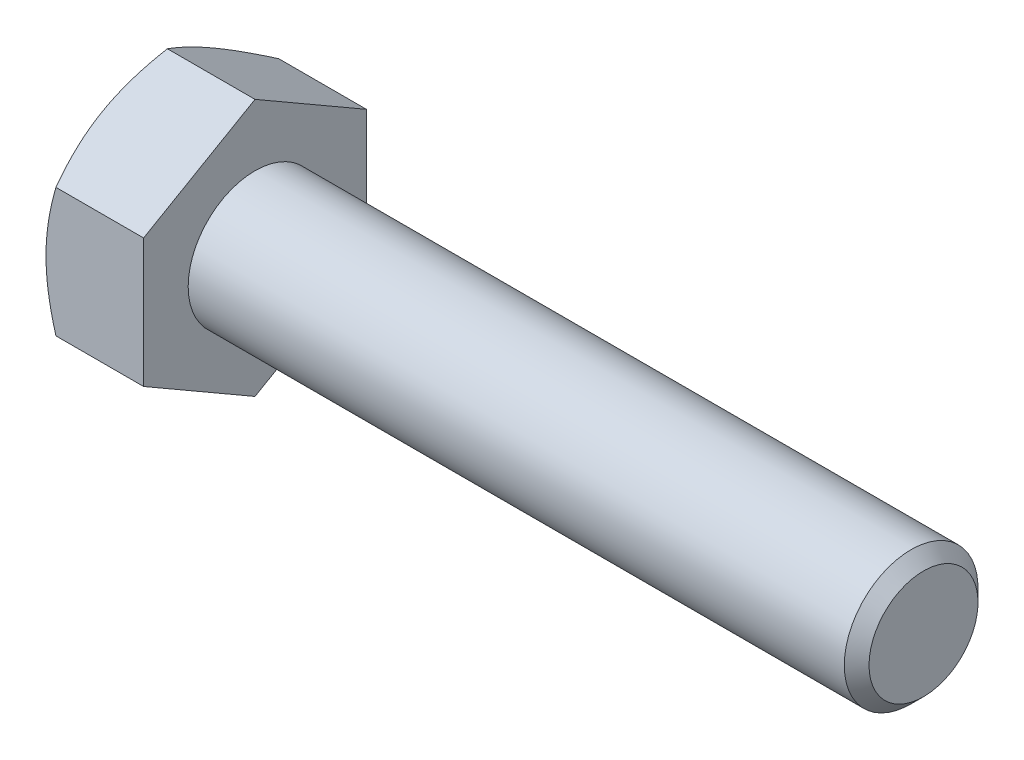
ISO-10303-21;
HEADER;
FILE_DESCRIPTION(('STEP AP214'),'2;1');
FILE_NAME('part.step','',(''),(''),'','','');
FILE_SCHEMA(('AUTOMOTIVE_DESIGN { 1 0 10303 214 1 1 1 1 }'));
ENDSEC;
DATA;
#1=APPLICATION_CONTEXT('core data for automotive mechanical design processes');
#2=APPLICATION_PROTOCOL_DEFINITION('international standard','automotive_design',2000,#1);
#3=PRODUCT_CONTEXT('',#1,'mechanical');
#4=PRODUCT('Part','Part','',(#3));
#5=PRODUCT_RELATED_PRODUCT_CATEGORY('part','',(#4));
#6=PRODUCT_DEFINITION_FORMATION('','',#4);
#7=PRODUCT_DEFINITION_CONTEXT('part definition',#1,'design');
#8=PRODUCT_DEFINITION('design','',#6,#7);
#9=PRODUCT_DEFINITION_SHAPE('','',#8);
#10=(LENGTH_UNIT() NAMED_UNIT(*) SI_UNIT(.MILLI.,.METRE.));
#11=(NAMED_UNIT(*) PLANE_ANGLE_UNIT() SI_UNIT($,.RADIAN.));
#12=(NAMED_UNIT(*) SI_UNIT($,.STERADIAN.) SOLID_ANGLE_UNIT());
#13=UNCERTAINTY_MEASURE_WITH_UNIT(LENGTH_MEASURE(1.E-05),#10,'distance_accuracy_value','');
#14=(GEOMETRIC_REPRESENTATION_CONTEXT(3) GLOBAL_UNCERTAINTY_ASSIGNED_CONTEXT((#13)) GLOBAL_UNIT_ASSIGNED_CONTEXT((#10,
#11,#12)) REPRESENTATION_CONTEXT('',''));
#15=CARTESIAN_POINT('',(0.,0.,0.));
#16=DIRECTION('',(0.,0.,1.));
#17=DIRECTION('',(1.,0.,0.));
#18=AXIS2_PLACEMENT_3D('',#15,#16,#17);
#19=CARTESIAN_POINT('',(4.38,2.88675134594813,-5.));
#20=DIRECTION('',(0.,-0.866025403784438,0.500000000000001));
#21=DIRECTION('',(0.,-0.500000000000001,-0.866025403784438));
#22=AXIS2_PLACEMENT_3D('',#19,#20,#21);
#23=PLANE('',#22);
#24=CARTESIAN_POINT('',(0.446648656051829,5.7736181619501,0.000200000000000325));
#25=CARTESIAN_POINT('',(0.373386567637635,5.64675433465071,-0.219534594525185));
#26=CARTESIAN_POINT('',(0.306751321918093,5.5188054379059,-0.44114858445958));
#27=CARTESIAN_POINT('',(0.190438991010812,5.26069210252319,-0.888213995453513));
#28=CARTESIAN_POINT('',(0.14080304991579,5.13052307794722,-1.11367335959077));
#29=CARTESIAN_POINT('',(0.0635510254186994,4.87177839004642,-1.56183230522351));
#30=CARTESIAN_POINT('',(0.035420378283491,4.74324302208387,-1.78446209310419));
#31=CARTESIAN_POINT('',(0.010194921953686,4.54998783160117,-2.11918990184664));
#32=CARTESIAN_POINT('',(0.00461345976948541,4.48552534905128,-2.23084219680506));
#33=CARTESIAN_POINT('',(-0.000797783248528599,4.35654081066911,-2.4542499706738));
#34=CARTESIAN_POINT('',(-0.000627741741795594,4.2920187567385,-2.56600544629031));
#35=CARTESIAN_POINT('',(0.00775363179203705,4.11524635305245,-2.87218423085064));
#36=CARTESIAN_POINT('',(0.0218297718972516,4.00305457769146,-3.06650608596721));
#37=CARTESIAN_POINT('',(0.06646525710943,3.77941563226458,-3.4538601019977));
#38=CARTESIAN_POINT('',(0.0970398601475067,3.66796924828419,-3.64689090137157));
#39=CARTESIAN_POINT('',(0.173468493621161,3.44387972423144,-4.03502534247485));
#40=CARTESIAN_POINT('',(0.219646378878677,3.3312648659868,-4.23007999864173));
#41=CARTESIAN_POINT('',(0.32445179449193,3.1077146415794,-4.61728034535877));
#42=CARTESIAN_POINT('',(0.38305470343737,2.99677641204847,-4.80943099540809));
#43=CARTESIAN_POINT('',(0.446648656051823,2.88663587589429,-5.0002));
#44=B_SPLINE_CURVE_WITH_KNOTS('',3,(#24,#25,#26,#27,#28,#29,#30,#31,#32,#33,#34,#35,#36,#37,#38,
#39,#40,#41,#42,#43),.UNSPECIFIED.,.F.,.F.,(4,2,2,2,2,2,2,2,2,4),(0.,0.792555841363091,
1.58701660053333,2.36181537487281,2.74884076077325,3.13585419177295,3.80962362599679,
4.48401723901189,5.17336882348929,5.86136694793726),.UNSPECIFIED.);
#45=CARTESIAN_POINT('',(0.446581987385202,5.77350269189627,0.));
#46=VERTEX_POINT('',#45);
#47=CARTESIAN_POINT('',(0.,4.33012701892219,-2.50000000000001));
#48=VERTEX_POINT('',#47);
#49=EDGE_CURVE('E47',#46,#48,#44,.T.);
#50=ORIENTED_EDGE('',*,*,#49,.F.);
#51=DIRECTION('',(-1.,0.,0.));
#52=VECTOR('',#51,1.);
#53=CARTESIAN_POINT('',(4.38,5.77350269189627,0.));
#54=LINE('',#53,#52);
#55=CARTESIAN_POINT('',(4.38,5.77350269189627,0.));
#56=VERTEX_POINT('',#55);
#57=EDGE_CURVE('E143',#56,#46,#54,.T.);
#58=ORIENTED_EDGE('',*,*,#57,.F.);
#59=DIRECTION('',(0.,0.500000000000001,0.866025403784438));
#60=VECTOR('',#59,1.);
#61=CARTESIAN_POINT('',(4.38,2.88675134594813,-5.));
#62=LINE('',#61,#60);
#63=CARTESIAN_POINT('',(4.38,2.88675134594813,-5.));
#64=VERTEX_POINT('',#63);
#65=EDGE_CURVE('E228',#64,#56,#62,.T.);
#66=ORIENTED_EDGE('',*,*,#65,.F.);
#67=DIRECTION('',(-1.,0.,0.));
#68=VECTOR('',#67,1.);
#69=CARTESIAN_POINT('',(4.38,2.88675134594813,-5.));
#70=LINE('',#69,#68);
#71=CARTESIAN_POINT('',(0.446581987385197,2.88675134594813,-5.));
#72=VERTEX_POINT('',#71);
#73=EDGE_CURVE('E131',#64,#72,#70,.T.);
#74=ORIENTED_EDGE('',*,*,#73,.T.);
#75=EDGE_CURVE('E125',#48,#72,#44,.T.);
#76=ORIENTED_EDGE('',*,*,#75,.F.);
#77=EDGE_LOOP('',(#50,#58,#66,#74,#76));
#78=FACE_BOUND('',#77,.T.);
#79=ADVANCED_FACE('F31',(#78),#23,.F.);
#80=CARTESIAN_POINT('',(4.38,5.77350269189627,0.));
#81=DIRECTION('',(0.,-0.866025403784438,-0.500000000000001));
#82=DIRECTION('',(0.,0.500000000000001,-0.866025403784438));
#83=AXIS2_PLACEMENT_3D('',#80,#81,#82);
#84=PLANE('',#83);
#85=CARTESIAN_POINT('',(0.446648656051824,2.88663587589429,5.0002));
#86=CARTESIAN_POINT('',(0.373386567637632,3.01349970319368,4.78046540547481));
#87=CARTESIAN_POINT('',(0.30675132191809,3.14144859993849,4.55885141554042));
#88=CARTESIAN_POINT('',(0.19043899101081,3.39956193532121,4.11178600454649));
#89=CARTESIAN_POINT('',(0.140803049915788,3.52973095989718,3.88632664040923));
#90=CARTESIAN_POINT('',(0.0635510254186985,3.78847564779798,3.43816769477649));
#91=CARTESIAN_POINT('',(0.035420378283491,3.91701101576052,3.21553790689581));
#92=CARTESIAN_POINT('',(0.0101949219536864,4.11026620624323,2.88081009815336));
#93=CARTESIAN_POINT('',(0.00461345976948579,4.17472868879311,2.76915780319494));
#94=CARTESIAN_POINT('',(-0.000797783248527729,4.30371322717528,2.5457500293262));
#95=CARTESIAN_POINT('',(-0.000627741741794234,4.36823528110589,2.43399455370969));
#96=CARTESIAN_POINT('',(0.0077536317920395,4.54500768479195,2.12781576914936));
#97=CARTESIAN_POINT('',(0.0218297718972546,4.65719946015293,1.93349391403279));
#98=CARTESIAN_POINT('',(0.0664652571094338,4.88083840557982,1.5461398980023));
#99=CARTESIAN_POINT('',(0.097039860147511,4.99228478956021,1.35310909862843));
#100=CARTESIAN_POINT('',(0.173468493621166,5.21637431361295,0.964974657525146));
#101=CARTESIAN_POINT('',(0.219646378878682,5.32898917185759,0.769920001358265));
#102=CARTESIAN_POINT('',(0.324451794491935,5.55253939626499,0.382719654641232));
#103=CARTESIAN_POINT('',(0.383054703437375,5.66347762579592,0.190569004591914));
#104=CARTESIAN_POINT('',(0.446648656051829,5.7736181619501,-0.000199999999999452));
#105=B_SPLINE_CURVE_WITH_KNOTS('',3,(#85,#86,#87,#88,#89,#90,#91,#92,#93,#94,#95,#96,#97,#98,
#99,#100,#101,#102,#103,#104),.UNSPECIFIED.,.F.,.F.,(4,2,2,2,2,2,2,2,2,4),(0.,0.79255584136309,
1.58701660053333,2.3618153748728,2.74884076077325,3.13585419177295,3.80962362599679,
4.48401723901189,5.17336882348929,5.86136694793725),.UNSPECIFIED.);
#106=CARTESIAN_POINT('',(0.446581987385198,2.88675134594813,5.));
#107=VERTEX_POINT('',#106);
#108=CARTESIAN_POINT('',(0.,4.33012701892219,2.5));
#109=VERTEX_POINT('',#108);
#110=EDGE_CURVE('E54',#107,#109,#105,.T.);
#111=ORIENTED_EDGE('',*,*,#110,.F.);
#112=DIRECTION('',(-1.,0.,0.));
#113=VECTOR('',#112,1.);
#114=CARTESIAN_POINT('',(4.38,2.88675134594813,5.));
#115=LINE('',#114,#113);
#116=CARTESIAN_POINT('',(4.38,2.88675134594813,5.));
#117=VERTEX_POINT('',#116);
#118=EDGE_CURVE('E141',#117,#107,#115,.T.);
#119=ORIENTED_EDGE('',*,*,#118,.F.);
#120=DIRECTION('',(0.,-0.500000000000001,0.866025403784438));
#121=VECTOR('',#120,1.);
#122=CARTESIAN_POINT('',(4.38,5.77350269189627,0.));
#123=LINE('',#122,#121);
#124=EDGE_CURVE('E226',#56,#117,#123,.T.);
#125=ORIENTED_EDGE('',*,*,#124,.F.);
#126=ORIENTED_EDGE('',*,*,#57,.T.);
#127=EDGE_CURVE('E158',#109,#46,#105,.T.);
#128=ORIENTED_EDGE('',*,*,#127,.F.);
#129=EDGE_LOOP('',(#111,#119,#125,#126,#128));
#130=FACE_BOUND('',#129,.T.);
#131=ADVANCED_FACE('F164',(#130),#84,.F.);
#132=CARTESIAN_POINT('',(4.38,2.88675134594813,5.));
#133=DIRECTION('',(0.,0.,-1.));
#134=DIRECTION('',(0.,1.,0.));
#135=AXIS2_PLACEMENT_3D('',#132,#133,#134);
#136=PLANE('',#135);
#137=CARTESIAN_POINT('',(2.47533544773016,-7.82661640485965,5.));
#138=CARTESIAN_POINT('',(2.36879683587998,-7.60758613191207,5.));
#139=CARTESIAN_POINT('',(2.26325911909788,-7.38806071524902,5.));
#140=CARTESIAN_POINT('',(2.05474707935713,-6.94775649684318,5.));
#141=CARTESIAN_POINT('',(1.95177314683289,-6.72697751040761,5.));
#142=CARTESIAN_POINT('',(1.74844778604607,-6.28280027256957,5.));
#143=CARTESIAN_POINT('',(1.64811306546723,-6.05939434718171,5.));
#144=CARTESIAN_POINT('',(1.45145486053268,-5.61083043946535,5.));
#145=CARTESIAN_POINT('',(1.35513119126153,-5.38567253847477,5.));
#146=CARTESIAN_POINT('',(1.1644503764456,-4.92576614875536,5.));
#147=CARTESIAN_POINT('',(1.07026351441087,-4.69094667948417,5.));
#148=CARTESIAN_POINT('',(0.888844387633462,-4.21858752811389,5.));
#149=CARTESIAN_POINT('',(0.801612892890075,-3.9810475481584,5.));
#150=CARTESIAN_POINT('',(0.636341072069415,-3.50329086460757,5.));
#151=CARTESIAN_POINT('',(0.558282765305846,-3.26308044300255,5.));
#152=CARTESIAN_POINT('',(0.413813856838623,-2.77921467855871,5.));
#153=CARTESIAN_POINT('',(0.347399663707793,-2.53556042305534,5.));
#154=CARTESIAN_POINT('',(0.229707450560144,-2.04600448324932,5.));
#155=CARTESIAN_POINT('',(0.178346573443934,-1.80012308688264,5.));
#156=CARTESIAN_POINT('',(0.093623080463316,-1.30522837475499,5.));
#157=CARTESIAN_POINT('',(0.0602585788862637,-1.05621538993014,5.));
#158=CARTESIAN_POINT('',(0.0146229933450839,-0.559584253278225,5.));
#159=CARTESIAN_POINT('',(0.00207498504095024,-0.31199219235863,5.));
#160=CARTESIAN_POINT('',(-0.00159747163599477,0.183375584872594,5.));
#161=CARTESIAN_POINT('',(0.0072784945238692,0.431151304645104,5.));
#162=CARTESIAN_POINT('',(0.039726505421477,0.849622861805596,5.));
#163=CARTESIAN_POINT('',(0.0579847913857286,1.02075746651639,5.));
#164=CARTESIAN_POINT('',(0.103624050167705,1.36181398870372,5.));
#165=CARTESIAN_POINT('',(0.131006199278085,1.53173574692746,5.));
#166=CARTESIAN_POINT('',(0.225403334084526,2.03942834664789,5.));
#167=CARTESIAN_POINT('',(0.304653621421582,2.37495177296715,5.));
#168=CARTESIAN_POINT('',(0.442611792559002,2.87686006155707,5.));
#169=CARTESIAN_POINT('',(0.49245303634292,3.04583048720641,5.));
#170=CARTESIAN_POINT('',(0.597441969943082,3.38213061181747,5.));
#171=CARTESIAN_POINT('',(0.652589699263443,3.5494602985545,5.));
#172=CARTESIAN_POINT('',(0.767295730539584,3.88253122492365,5.));
#173=CARTESIAN_POINT('',(0.826852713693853,4.04827292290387,5.));
#174=CARTESIAN_POINT('',(0.949663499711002,4.37837269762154,5.));
#175=CARTESIAN_POINT('',(1.01291722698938,4.54273080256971,5.));
#176=CARTESIAN_POINT('',(1.18384085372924,4.9746759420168,5.));
#177=CARTESIAN_POINT('',(1.29410564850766,5.24123504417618,5.));
#178=CARTESIAN_POINT('',(1.52085041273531,5.77170603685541,5.));
#179=CARTESIAN_POINT('',(1.63733099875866,6.03561766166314,5.));
#180=CARTESIAN_POINT('',(1.87507624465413,6.56138078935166,5.));
#181=CARTESIAN_POINT('',(1.99634255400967,6.82323154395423,5.));
#182=CARTESIAN_POINT('',(2.24254703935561,7.34518395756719,5.));
#183=CARTESIAN_POINT('',(2.36748508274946,7.60528567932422,5.));
#184=CARTESIAN_POINT('',(2.62044102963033,8.1244647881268,5.));
#185=CARTESIAN_POINT('',(2.74846325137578,8.38354006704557,5.));
#186=CARTESIAN_POINT('',(3.00682669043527,8.90053291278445,5.));
#187=CARTESIAN_POINT('',(3.1371679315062,9.15845046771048,5.));
#188=CARTESIAN_POINT('',(3.53092424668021,9.93067662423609,5.));
#189=CARTESIAN_POINT('',(3.79712405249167,10.443564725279,5.));
#190=CARTESIAN_POINT('',(4.30724046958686,11.4147548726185,5.));
#191=CARTESIAN_POINT('',(4.55067498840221,11.8733113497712,5.));
#192=CARTESIAN_POINT('',(5.04052915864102,12.7888590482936,5.));
#193=CARTESIAN_POINT('',(5.28694897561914,13.2458501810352,5.));
#194=CARTESIAN_POINT('',(5.78122505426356,14.1571829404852,5.));
#195=CARTESIAN_POINT('',(6.02907430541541,14.6115283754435,5.));
#196=CARTESIAN_POINT('',(6.52648185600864,15.519239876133,5.));
#197=CARTESIAN_POINT('',(6.77604002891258,15.9726060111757,5.));
#198=CARTESIAN_POINT('',(7.02622264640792,16.4256251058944,4.99999999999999));
#199=B_SPLINE_CURVE_WITH_KNOTS('',3,(#137,#138,#139,#140,#141,#142,#143,#144,#145,#146,#147,
#148,#149,#150,#151,#152,#153,#154,#155,#156,#157,#158,#159,#160,#161,#162,#163,#164,#165,#166,
#167,#168,#169,#170,#171,#172,#173,#174,#175,#176,#177,#178,#179,#180,#181,#182,#183,#184,#185,
#186,#187,#188,#189,#190,#191,#192,#193,#194,#195,#196,#197,#198),.UNSPECIFIED.,.F.,.F.,(4,2,2,
2,2,2,2,2,2,2,2,2,2,2,2,2,2,2,2,2,2,2,2,2,2,2,2,2,2,2,4),(0.,0.730708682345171,1.46152797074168,
2.19620403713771,2.93084619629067,3.6897749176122,4.4487875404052,5.20628666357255,
5.96355173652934,6.71656679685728,7.46950293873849,8.21233991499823,8.95519126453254,
9.4712599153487,9.98739512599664,11.0201893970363,11.5486465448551,12.0771076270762,
12.6054112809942,13.1337041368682,13.9989833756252,14.8643486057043,15.7300147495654,
16.5956496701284,17.4625765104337,18.329512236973,20.0630293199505,21.6205191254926,
23.178095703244,24.7307447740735,26.2832800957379),.UNSPECIFIED.);
#200=CARTESIAN_POINT('',(0.446581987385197,-2.88675134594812,5.));
#201=VERTEX_POINT('',#200);
#202=CARTESIAN_POINT('',(0.,0.,5.));
#203=VERTEX_POINT('',#202);
#204=EDGE_CURVE('E238',#201,#203,#199,.T.);
#205=ORIENTED_EDGE('',*,*,#204,.F.);
#206=DIRECTION('',(-1.,0.,0.));
#207=VECTOR('',#206,1.);
#208=CARTESIAN_POINT('',(4.38,-2.88675134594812,5.));
#209=LINE('',#208,#207);
#210=CARTESIAN_POINT('',(4.38,-2.88675134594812,5.));
#211=VERTEX_POINT('',#210);
#212=EDGE_CURVE('E133',#211,#201,#209,.T.);
#213=ORIENTED_EDGE('',*,*,#212,.F.);
#214=DIRECTION('',(0.,-1.,0.));
#215=VECTOR('',#214,1.);
#216=CARTESIAN_POINT('',(4.38,2.88675134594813,5.));
#217=LINE('',#216,#215);
#218=EDGE_CURVE('E222',#117,#211,#217,.T.);
#219=ORIENTED_EDGE('',*,*,#218,.F.);
#220=ORIENTED_EDGE('',*,*,#118,.T.);
#221=EDGE_CURVE('E180',#203,#107,#199,.T.);
#222=ORIENTED_EDGE('',*,*,#221,.F.);
#223=EDGE_LOOP('',(#205,#213,#219,#220,#222));
#224=FACE_BOUND('',#223,.T.);
#225=ADVANCED_FACE('F244',(#224),#136,.F.);
#226=CARTESIAN_POINT('',(4.38,-5.77350269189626,0.));
#227=DIRECTION('',(0.,0.866025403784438,-0.500000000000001));
#228=DIRECTION('',(0.,0.500000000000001,0.866025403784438));
#229=AXIS2_PLACEMENT_3D('',#226,#227,#228);
#230=PLANE('',#229);
#231=CARTESIAN_POINT('',(0.446648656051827,-5.7736181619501,-0.000199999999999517));
#232=CARTESIAN_POINT('',(0.373386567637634,-5.64675433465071,0.219534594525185));
#233=CARTESIAN_POINT('',(0.306751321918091,-5.5188054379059,0.44114858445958));
#234=CARTESIAN_POINT('',(0.19043899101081,-5.26069210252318,0.888213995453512));
#235=CARTESIAN_POINT('',(0.140803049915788,-5.13052307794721,1.11367335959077));
#236=CARTESIAN_POINT('',(0.0635510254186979,-4.87177839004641,1.56183230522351));
#237=CARTESIAN_POINT('',(0.0354203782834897,-4.74324302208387,1.78446209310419));
#238=CARTESIAN_POINT('',(0.0101949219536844,-4.54998783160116,2.11918990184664));
#239=CARTESIAN_POINT('',(0.00461345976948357,-4.48552534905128,2.23084219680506));
#240=CARTESIAN_POINT('',(-0.000797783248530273,-4.35654081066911,2.4542499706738));
#241=CARTESIAN_POINT('',(-0.000627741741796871,-4.2920187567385,2.56600544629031));
#242=CARTESIAN_POINT('',(0.00775363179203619,-4.11524635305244,2.87218423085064));
#243=CARTESIAN_POINT('',(0.0218297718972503,-4.00305457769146,3.06650608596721));
#244=CARTESIAN_POINT('',(0.0664652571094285,-3.77941563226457,3.4538601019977));
#245=CARTESIAN_POINT('',(0.0970398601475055,-3.66796924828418,3.64689090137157));
#246=CARTESIAN_POINT('',(0.173468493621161,-3.44387972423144,4.03502534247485));
#247=CARTESIAN_POINT('',(0.219646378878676,-3.3312648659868,4.23007999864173));
#248=CARTESIAN_POINT('',(0.32445179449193,-3.1077146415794,4.61728034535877));
#249=CARTESIAN_POINT('',(0.383054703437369,-2.99677641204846,4.80943099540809));
#250=CARTESIAN_POINT('',(0.446648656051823,-2.88663587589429,5.0002));
#251=B_SPLINE_CURVE_WITH_KNOTS('',3,(#231,#232,#233,#234,#235,#236,#237,#238,#239,#240,#241,
#242,#243,#244,#245,#246,#247,#248,#249,#250),.UNSPECIFIED.,.F.,.F.,(4,2,2,2,2,2,2,2,2,4),(0.,
0.79255584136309,1.58701660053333,2.3618153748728,2.74884076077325,3.13585419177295,
3.80962362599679,4.48401723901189,5.17336882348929,5.86136694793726),.UNSPECIFIED.);
#252=CARTESIAN_POINT('',(0.4465819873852,-5.77350269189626,0.));
#253=VERTEX_POINT('',#252);
#254=CARTESIAN_POINT('',(0.,-4.33012701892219,2.50000000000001));
#255=VERTEX_POINT('',#254);
#256=EDGE_CURVE('E166',#253,#255,#251,.T.);
#257=ORIENTED_EDGE('',*,*,#256,.F.);
#258=DIRECTION('',(-1.,0.,0.));
#259=VECTOR('',#258,1.);
#260=CARTESIAN_POINT('',(4.38,-5.77350269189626,0.));
#261=LINE('',#260,#259);
#262=CARTESIAN_POINT('',(4.38,-5.77350269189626,0.));
#263=VERTEX_POINT('',#262);
#264=EDGE_CURVE('E130',#263,#253,#261,.T.);
#265=ORIENTED_EDGE('',*,*,#264,.F.);
#266=DIRECTION('',(0.,-0.500000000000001,-0.866025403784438));
#267=VECTOR('',#266,1.);
#268=CARTESIAN_POINT('',(4.38,-5.77350269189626,0.));
#269=LINE('',#268,#267);
#270=EDGE_CURVE('E220',#211,#263,#269,.T.);
#271=ORIENTED_EDGE('',*,*,#270,.F.);
#272=ORIENTED_EDGE('',*,*,#212,.T.);
#273=EDGE_CURVE('E168',#255,#201,#251,.T.);
#274=ORIENTED_EDGE('',*,*,#273,.F.);
#275=EDGE_LOOP('',(#257,#265,#271,#272,#274));
#276=FACE_BOUND('',#275,.T.);
#277=ADVANCED_FACE('F216',(#276),#230,.F.);
#278=CARTESIAN_POINT('',(4.38,-2.88675134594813,-5.));
#279=DIRECTION('',(0.,0.866025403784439,0.5));
#280=DIRECTION('',(0.,-0.5,0.866025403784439));
#281=AXIS2_PLACEMENT_3D('',#278,#279,#280);
#282=PLANE('',#281);
#283=CARTESIAN_POINT('',(0.446648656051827,-2.8866358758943,-5.0002));
#284=CARTESIAN_POINT('',(0.373386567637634,-3.01349970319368,-4.78046540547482));
#285=CARTESIAN_POINT('',(0.306751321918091,-3.1414485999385,-4.55885141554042));
#286=CARTESIAN_POINT('',(0.190438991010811,-3.39956193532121,-4.11178600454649));
#287=CARTESIAN_POINT('',(0.14080304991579,-3.52973095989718,-3.88632664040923));
#288=CARTESIAN_POINT('',(0.0635510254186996,-3.78847564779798,-3.43816769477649));
#289=CARTESIAN_POINT('',(0.0354203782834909,-3.91701101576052,-3.21553790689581));
#290=CARTESIAN_POINT('',(0.0101949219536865,-4.11026620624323,-2.88081009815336));
#291=CARTESIAN_POINT('',(0.00461345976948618,-4.17472868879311,-2.76915780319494));
#292=CARTESIAN_POINT('',(-0.000797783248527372,-4.30371322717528,-2.5457500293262));
#293=CARTESIAN_POINT('',(-0.000627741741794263,-4.36823528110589,-2.43399455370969));
#294=CARTESIAN_POINT('',(0.00775363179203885,-4.54500768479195,-2.12781576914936));
#295=CARTESIAN_POINT('',(0.021829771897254,-4.65719946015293,-1.93349391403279));
#296=CARTESIAN_POINT('',(0.066465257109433,-4.88083840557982,-1.5461398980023));
#297=CARTESIAN_POINT('',(0.0970398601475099,-4.99228478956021,-1.35310909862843));
#298=CARTESIAN_POINT('',(0.173468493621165,-5.21637431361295,-0.964974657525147));
#299=CARTESIAN_POINT('',(0.21964637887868,-5.32898917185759,-0.769920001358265));
#300=CARTESIAN_POINT('',(0.324451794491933,-5.55253939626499,-0.382719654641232));
#301=CARTESIAN_POINT('',(0.383054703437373,-5.66347762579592,-0.190569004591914));
#302=CARTESIAN_POINT('',(0.446648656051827,-5.7736181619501,0.000199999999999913));
#303=B_SPLINE_CURVE_WITH_KNOTS('',3,(#283,#284,#285,#286,#287,#288,#289,#290,#291,#292,#293,
#294,#295,#296,#297,#298,#299,#300,#301,#302),.UNSPECIFIED.,.F.,.F.,(4,2,2,2,2,2,2,2,2,4),(0.,
0.792555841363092,1.58701660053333,2.3618153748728,2.74884076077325,3.13585419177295,
3.80962362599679,4.48401723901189,5.17336882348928,5.86136694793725),.UNSPECIFIED.);
#304=CARTESIAN_POINT('',(0.446581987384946,-2.88675134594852,-5.));
#305=VERTEX_POINT('',#304);
#306=CARTESIAN_POINT('',(0.,-4.3301270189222,-2.5));
#307=VERTEX_POINT('',#306);
#308=EDGE_CURVE('E107',#305,#307,#303,.T.);
#309=ORIENTED_EDGE('',*,*,#308,.F.);
#310=DIRECTION('',(-1.,0.,0.));
#311=VECTOR('',#310,1.);
#312=CARTESIAN_POINT('',(4.38,-2.88675134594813,-5.));
#313=LINE('',#312,#311);
#314=CARTESIAN_POINT('',(4.38,-2.88675134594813,-5.));
#315=VERTEX_POINT('',#314);
#316=EDGE_CURVE('E121',#315,#305,#313,.T.);
#317=ORIENTED_EDGE('',*,*,#316,.F.);
#318=DIRECTION('',(0.,0.5,-0.866025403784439));
#319=VECTOR('',#318,1.);
#320=CARTESIAN_POINT('',(4.38,-2.88675134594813,-5.));
#321=LINE('',#320,#319);
#322=EDGE_CURVE('E218',#263,#315,#321,.T.);
#323=ORIENTED_EDGE('',*,*,#322,.F.);
#324=ORIENTED_EDGE('',*,*,#264,.T.);
#325=EDGE_CURVE('E124',#307,#253,#303,.T.);
#326=ORIENTED_EDGE('',*,*,#325,.F.);
#327=EDGE_LOOP('',(#309,#317,#323,#324,#326));
#328=FACE_BOUND('',#327,.T.);
#329=ADVANCED_FACE('F119',(#328),#282,.F.);
#330=CARTESIAN_POINT('',(4.38,2.88675134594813,-5.));
#331=DIRECTION('',(0.,0.,1.));
#332=DIRECTION('',(0.,-1.,0.));
#333=AXIS2_PLACEMENT_3D('',#330,#331,#332);
#334=PLANE('',#333);
#335=CARTESIAN_POINT('',(2.47533544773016,-7.82661640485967,-5.));
#336=CARTESIAN_POINT('',(2.36879683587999,-7.60758613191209,-5.));
#337=CARTESIAN_POINT('',(2.26325911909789,-7.38806071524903,-5.));
#338=CARTESIAN_POINT('',(2.05474707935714,-6.9477564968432,-5.));
#339=CARTESIAN_POINT('',(1.9517731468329,-6.72697751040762,-5.));
#340=CARTESIAN_POINT('',(1.74844778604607,-6.28280027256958,-5.));
#341=CARTESIAN_POINT('',(1.64811306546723,-6.05939434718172,-5.));
#342=CARTESIAN_POINT('',(1.45145486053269,-5.61083043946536,-5.));
#343=CARTESIAN_POINT('',(1.35513119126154,-5.38567253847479,-5.));
#344=CARTESIAN_POINT('',(1.16445037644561,-4.92576614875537,-5.));
#345=CARTESIAN_POINT('',(1.07026351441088,-4.69094667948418,-5.));
#346=CARTESIAN_POINT('',(0.888844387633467,-4.21858752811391,-5.));
#347=CARTESIAN_POINT('',(0.80161289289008,-3.98104754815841,-5.));
#348=CARTESIAN_POINT('',(0.63634107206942,-3.50329086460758,-5.));
#349=CARTESIAN_POINT('',(0.55828276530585,-3.26308044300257,-5.));
#350=CARTESIAN_POINT('',(0.413813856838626,-2.77921467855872,-5.));
#351=CARTESIAN_POINT('',(0.347399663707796,-2.53556042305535,-5.));
#352=CARTESIAN_POINT('',(0.229707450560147,-2.04600448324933,-5.));
#353=CARTESIAN_POINT('',(0.178346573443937,-1.80012308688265,-5.));
#354=CARTESIAN_POINT('',(0.0936230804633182,-1.305228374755,-5.));
#355=CARTESIAN_POINT('',(0.0602585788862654,-1.05621538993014,-5.));
#356=CARTESIAN_POINT('',(0.0146229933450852,-0.559584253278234,-5.));
#357=CARTESIAN_POINT('',(0.00207498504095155,-0.311992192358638,-5.));
#358=CARTESIAN_POINT('',(-0.00159747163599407,0.183375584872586,-5.));
#359=CARTESIAN_POINT('',(0.00727849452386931,0.431151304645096,-5.));
#360=CARTESIAN_POINT('',(0.0397265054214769,0.849622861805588,-5.));
#361=CARTESIAN_POINT('',(0.0579847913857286,1.02075746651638,-5.));
#362=CARTESIAN_POINT('',(0.103624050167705,1.36181398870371,-5.));
#363=CARTESIAN_POINT('',(0.131006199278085,1.53173574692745,-5.));
#364=CARTESIAN_POINT('',(0.225403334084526,2.03942834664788,-5.));
#365=CARTESIAN_POINT('',(0.304653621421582,2.37495177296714,-5.));
#366=CARTESIAN_POINT('',(0.442611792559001,2.87686006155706,-5.));
#367=CARTESIAN_POINT('',(0.492453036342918,3.0458304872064,-5.));
#368=CARTESIAN_POINT('',(0.59744196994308,3.38213061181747,-5.));
#369=CARTESIAN_POINT('',(0.652589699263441,3.5494602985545,-5.));
#370=CARTESIAN_POINT('',(0.767295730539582,3.88253122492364,-5.));
#371=CARTESIAN_POINT('',(0.826852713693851,4.04827292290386,-5.));
#372=CARTESIAN_POINT('',(0.949663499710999,4.37837269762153,-5.));
#373=CARTESIAN_POINT('',(1.01291722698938,4.5427308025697,-5.));
#374=CARTESIAN_POINT('',(1.18384085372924,4.9746759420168,-5.));
#375=CARTESIAN_POINT('',(1.29410564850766,5.24123504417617,-5.));
#376=CARTESIAN_POINT('',(1.5208504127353,5.7717060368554,-5.));
#377=CARTESIAN_POINT('',(1.63733099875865,6.03561766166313,-5.));
#378=CARTESIAN_POINT('',(1.87507624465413,6.56138078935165,-5.));
#379=CARTESIAN_POINT('',(1.99634255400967,6.82323154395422,-5.));
#380=CARTESIAN_POINT('',(2.24254703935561,7.34518395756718,-5.));
#381=CARTESIAN_POINT('',(2.36748508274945,7.60528567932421,-5.));
#382=CARTESIAN_POINT('',(2.62044102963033,8.12446478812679,-5.));
#383=CARTESIAN_POINT('',(2.74846325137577,8.38354006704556,-5.));
#384=CARTESIAN_POINT('',(3.00682669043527,8.90053291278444,-5.));
#385=CARTESIAN_POINT('',(3.1371679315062,9.15845046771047,-5.));
#386=CARTESIAN_POINT('',(3.53092424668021,9.93067662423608,-5.));
#387=CARTESIAN_POINT('',(3.79712405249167,10.443564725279,-5.));
#388=CARTESIAN_POINT('',(4.30724046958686,11.4147548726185,-5.));
#389=CARTESIAN_POINT('',(4.55067498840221,11.8733113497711,-5.));
#390=CARTESIAN_POINT('',(5.04052915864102,12.7888590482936,-5.));
#391=CARTESIAN_POINT('',(5.28694897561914,13.2458501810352,-5.));
#392=CARTESIAN_POINT('',(5.78122505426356,14.1571829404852,-5.));
#393=CARTESIAN_POINT('',(6.02907430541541,14.6115283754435,-5.));
#394=CARTESIAN_POINT('',(6.52648185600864,15.519239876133,-5.));
#395=CARTESIAN_POINT('',(6.77604002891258,15.9726060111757,-5.));
#396=CARTESIAN_POINT('',(7.02622264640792,16.4256251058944,-5.));
#397=B_SPLINE_CURVE_WITH_KNOTS('',3,(#335,#336,#337,#338,#339,#340,#341,#342,#343,#344,#345,
#346,#347,#348,#349,#350,#351,#352,#353,#354,#355,#356,#357,#358,#359,#360,#361,#362,#363,#364,
#365,#366,#367,#368,#369,#370,#371,#372,#373,#374,#375,#376,#377,#378,#379,#380,#381,#382,#383,
#384,#385,#386,#387,#388,#389,#390,#391,#392,#393,#394,#395,#396),.UNSPECIFIED.,.F.,.F.,(4,2,2,
2,2,2,2,2,2,2,2,2,2,2,2,2,2,2,2,2,2,2,2,2,2,2,2,2,2,2,4),(0.,0.730708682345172,1.46152797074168,
2.19620403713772,2.93084619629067,3.6897749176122,4.4487875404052,5.20628666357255,
5.96355173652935,6.71656679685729,7.4695029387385,8.21233991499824,8.95519126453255,
9.4712599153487,9.98739512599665,11.0201893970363,11.5486465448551,12.0771076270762,
12.6054112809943,13.1337041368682,13.9989833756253,14.8643486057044,15.7300147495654,
16.5956496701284,17.4625765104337,18.329512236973,20.0630293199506,21.6205191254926,
23.178095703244,24.7307447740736,26.2832800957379),.UNSPECIFIED.);
#398=CARTESIAN_POINT('',(0.,0.,-5.));
#399=VERTEX_POINT('',#398);
#400=EDGE_CURVE('E113',#72,#399,#397,.F.);
#401=ORIENTED_EDGE('',*,*,#400,.F.);
#402=ORIENTED_EDGE('',*,*,#73,.F.);
#403=DIRECTION('',(0.,1.,0.));
#404=VECTOR('',#403,1.);
#405=CARTESIAN_POINT('',(4.38,2.88675134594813,-5.));
#406=LINE('',#405,#404);
#407=EDGE_CURVE('E129',#315,#64,#406,.T.);
#408=ORIENTED_EDGE('',*,*,#407,.F.);
#409=ORIENTED_EDGE('',*,*,#316,.T.);
#410=EDGE_CURVE('E104',#399,#305,#397,.F.);
#411=ORIENTED_EDGE('',*,*,#410,.F.);
#412=EDGE_LOOP('',(#401,#402,#408,#409,#411));
#413=FACE_BOUND('',#412,.T.);
#414=ADVANCED_FACE('F127',(#413),#334,.F.);
#415=CARTESIAN_POINT('',(4.38,5.77350269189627,0.));
#416=DIRECTION('',(1.,0.,0.));
#417=DIRECTION('',(0.,0.,-1.));
#418=AXIS2_PLACEMENT_3D('',#415,#416,#417);
#419=PLANE('',#418);
#420=ORIENTED_EDGE('',*,*,#65,.T.);
#421=ORIENTED_EDGE('',*,*,#124,.T.);
#422=ORIENTED_EDGE('',*,*,#218,.T.);
#423=ORIENTED_EDGE('',*,*,#270,.T.);
#424=ORIENTED_EDGE('',*,*,#322,.T.);
#425=ORIENTED_EDGE('',*,*,#407,.T.);
#426=EDGE_LOOP('',(#420,#421,#422,#423,#424,#425));
#427=FACE_BOUND('',#426,.T.);
#428=CARTESIAN_POINT('',(4.38,0.,0.));
#429=DIRECTION('',(1.,0.,0.));
#430=DIRECTION('',(0.,0.,-1.));
#431=AXIS2_PLACEMENT_3D('',#428,#429,#430);
#432=CIRCLE('',#431,3.);
#433=CARTESIAN_POINT('',(4.38,0.,-3.));
#434=VERTEX_POINT('',#433);
#435=EDGE_CURVE('E231',#434,#434,#432,.F.);
#436=ORIENTED_EDGE('',*,*,#435,.T.);
#437=EDGE_LOOP('',(#436));
#438=FACE_BOUND('',#437,.T.);
#439=ADVANCED_FACE('F246',(#427,#438),#419,.T.);
#440=CARTESIAN_POINT('',(0.,0.,0.));
#441=DIRECTION('',(-1.,0.,0.));
#442=DIRECTION('',(0.,0.,1.));
#443=AXIS2_PLACEMENT_3D('',#440,#441,#442);
#444=CYLINDRICAL_SURFACE('',#443,3.);
#445=ORIENTED_EDGE('',*,*,#435,.F.);
#446=EDGE_LOOP('',(#445));
#447=FACE_BOUND('',#446,.T.);
#448=CARTESIAN_POINT('',(33.8255,0.,0.));
#449=DIRECTION('',(-1.,0.,0.));
#450=DIRECTION('',(0.,0.,1.));
#451=AXIS2_PLACEMENT_3D('',#448,#449,#450);
#452=CIRCLE('',#451,3.);
#453=CARTESIAN_POINT('',(33.8255,0.,3.));
#454=VERTEX_POINT('',#453);
#455=EDGE_CURVE('E234',#454,#454,#452,.T.);
#456=ORIENTED_EDGE('',*,*,#455,.T.);
#457=EDGE_LOOP('',(#456));
#458=FACE_BOUND('',#457,.T.);
#459=ADVANCED_FACE('F277',(#447,#458),#444,.T.);
#460=CARTESIAN_POINT('',(34.38,0.,0.));
#461=DIRECTION('',(-1.,0.,0.));
#462=DIRECTION('',(0.,0.,1.));
#463=AXIS2_PLACEMENT_3D('',#460,#461,#462);
#464=CONICAL_SURFACE('',#463,2.4455,0.785398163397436);
#465=ORIENTED_EDGE('',*,*,#455,.F.);
#466=EDGE_LOOP('',(#465));
#467=FACE_BOUND('',#466,.T.);
#468=CARTESIAN_POINT('',(34.38,0.,0.));
#469=DIRECTION('',(-1.,0.,0.));
#470=DIRECTION('',(0.,0.,1.));
#471=AXIS2_PLACEMENT_3D('',#468,#469,#470);
#472=CIRCLE('',#471,2.4455);
#473=CARTESIAN_POINT('',(34.38,0.,2.4455));
#474=VERTEX_POINT('',#473);
#475=EDGE_CURVE('E236',#474,#474,#472,.T.);
#476=ORIENTED_EDGE('',*,*,#475,.T.);
#477=EDGE_LOOP('',(#476));
#478=FACE_BOUND('',#477,.T.);
#479=ADVANCED_FACE('F280',(#467,#478),#464,.T.);
#480=CARTESIAN_POINT('',(34.38,0.,0.));
#481=DIRECTION('',(-1.,0.,0.));
#482=DIRECTION('',(0.,0.,1.));
#483=AXIS2_PLACEMENT_3D('',#480,#481,#482);
#484=PLANE('',#483);
#485=ORIENTED_EDGE('',*,*,#475,.F.);
#486=EDGE_LOOP('',(#485));
#487=FACE_BOUND('',#486,.T.);
#488=ADVANCED_FACE('F193',(#487),#484,.F.);
#489=CARTESIAN_POINT('',(0.,0.,0.));
#490=DIRECTION('',(1.,0.,0.));
#491=DIRECTION('',(0.,0.,-1.));
#492=AXIS2_PLACEMENT_3D('',#489,#490,#491);
#493=CONICAL_SURFACE('',#492,5.,1.0471975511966);
#494=ORIENTED_EDGE('',*,*,#308,.T.);
#495=CARTESIAN_POINT('',(0.,0.,0.));
#496=DIRECTION('',(1.,0.,0.));
#497=DIRECTION('',(0.,0.,-1.));
#498=AXIS2_PLACEMENT_3D('',#495,#496,#497);
#499=CIRCLE('',#498,5.);
#500=EDGE_CURVE('E35',#307,#399,#499,.T.);
#501=ORIENTED_EDGE('',*,*,#500,.T.);
#502=ORIENTED_EDGE('',*,*,#410,.T.);
#503=EDGE_LOOP('',(#494,#501,#502));
#504=FACE_BOUND('',#503,.T.);
#505=ADVANCED_FACE('F106',(#504),#493,.T.);
#506=ORIENTED_EDGE('',*,*,#256,.T.);
#507=EDGE_CURVE('E148',#255,#307,#499,.T.);
#508=ORIENTED_EDGE('',*,*,#507,.T.);
#509=ORIENTED_EDGE('',*,*,#325,.T.);
#510=EDGE_LOOP('',(#506,#508,#509));
#511=FACE_BOUND('',#510,.T.);
#512=ADVANCED_FACE('F192',(#511),#493,.T.);
#513=ORIENTED_EDGE('',*,*,#204,.T.);
#514=EDGE_CURVE('E149',#203,#255,#499,.T.);
#515=ORIENTED_EDGE('',*,*,#514,.T.);
#516=ORIENTED_EDGE('',*,*,#273,.T.);
#517=EDGE_LOOP('',(#513,#515,#516));
#518=FACE_BOUND('',#517,.T.);
#519=ADVANCED_FACE('F187',(#518),#493,.T.);
#520=ORIENTED_EDGE('',*,*,#221,.T.);
#521=ORIENTED_EDGE('',*,*,#110,.T.);
#522=CARTESIAN_POINT('',(0.,0.,0.));
#523=DIRECTION('',(-1.,0.,0.));
#524=DIRECTION('',(0.,0.,1.));
#525=AXIS2_PLACEMENT_3D('',#522,#523,#524);
#526=CIRCLE('',#525,5.);
#527=EDGE_CURVE('E114',#203,#109,#526,.T.);
#528=ORIENTED_EDGE('',*,*,#527,.F.);
#529=EDGE_LOOP('',(#520,#521,#528));
#530=FACE_BOUND('',#529,.T.);
#531=ADVANCED_FACE('F191',(#530),#493,.T.);
#532=ORIENTED_EDGE('',*,*,#127,.T.);
#533=ORIENTED_EDGE('',*,*,#49,.T.);
#534=EDGE_CURVE('E40',#48,#109,#499,.T.);
#535=ORIENTED_EDGE('',*,*,#534,.T.);
#536=EDGE_LOOP('',(#532,#533,#535));
#537=FACE_BOUND('',#536,.T.);
#538=ADVANCED_FACE('F157',(#537),#493,.T.);
#539=ORIENTED_EDGE('',*,*,#75,.T.);
#540=ORIENTED_EDGE('',*,*,#400,.T.);
#541=EDGE_CURVE('E11',#399,#48,#499,.T.);
#542=ORIENTED_EDGE('',*,*,#541,.T.);
#543=EDGE_LOOP('',(#539,#540,#542));
#544=FACE_BOUND('',#543,.T.);
#545=ADVANCED_FACE('F250',(#544),#493,.T.);
#546=CARTESIAN_POINT('',(0.,5.77350269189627,0.));
#547=DIRECTION('',(1.,0.,0.));
#548=DIRECTION('',(0.,0.,-1.));
#549=AXIS2_PLACEMENT_3D('',#546,#547,#548);
#550=PLANE('',#549);
#551=ORIENTED_EDGE('',*,*,#541,.F.);
#552=ORIENTED_EDGE('',*,*,#500,.F.);
#553=ORIENTED_EDGE('',*,*,#507,.F.);
#554=ORIENTED_EDGE('',*,*,#514,.F.);
#555=ORIENTED_EDGE('',*,*,#527,.T.);
#556=ORIENTED_EDGE('',*,*,#534,.F.);
#557=EDGE_LOOP('',(#551,#552,#553,#554,#555,#556));
#558=FACE_BOUND('',#557,.T.);
#559=ADVANCED_FACE('F161',(#558),#550,.F.);
#560=CLOSED_SHELL('',(#79,#131,#225,#277,#329,#414,#439,#459,#479,#488,#505,#512,#519,#531,#538,
#545,#559));
#561=MANIFOLD_SOLID_BREP('B2',#560);
#562=ADVANCED_BREP_SHAPE_REPRESENTATION('',(#18,#561),#14);
#563=SHAPE_DEFINITION_REPRESENTATION(#9,#562);
ENDSEC;
END-ISO-10303-21;
